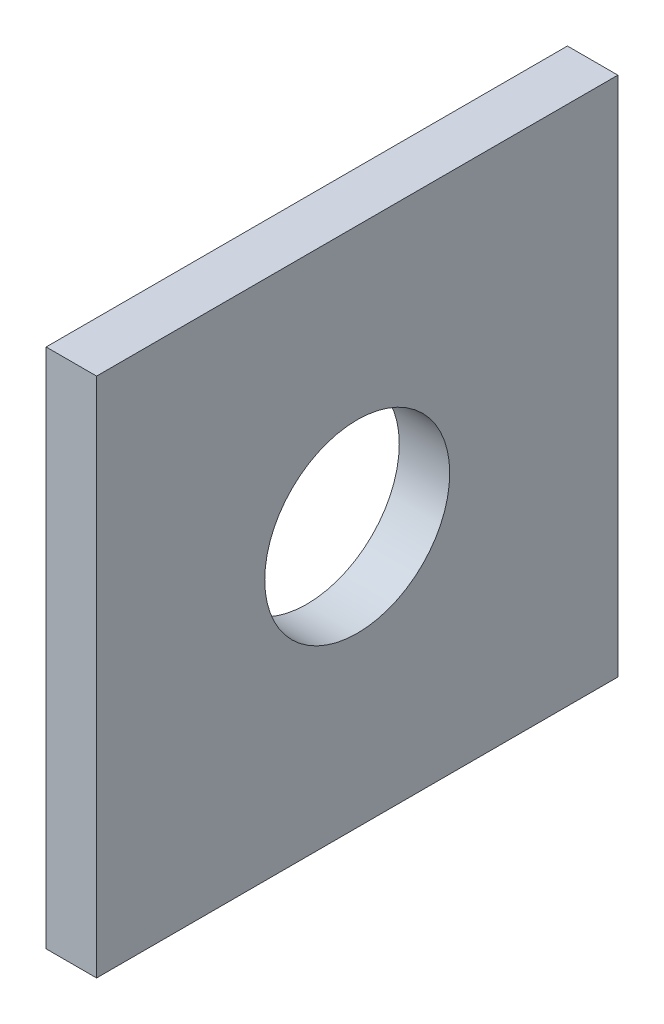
from build123d import *

# Parameters (mm, degrees)
SKETCH1_W  = 62
SKETCH1_H  = 62
SKETCH1_R  = 11
BODY_DEPTH = 6


with BuildPart() as part:
    # Sketch1 → Body (new body)
    with BuildSketch(Plane(origin=(0, 0, 0), x_dir=(0, 0, -1), z_dir=(1, 0, 0))):
        Rectangle(SKETCH1_W, SKETCH1_H)
        Circle(SKETCH1_R, mode=Mode.SUBTRACT)
    extrude(amount=-BODY_DEPTH)


solid = part.part
